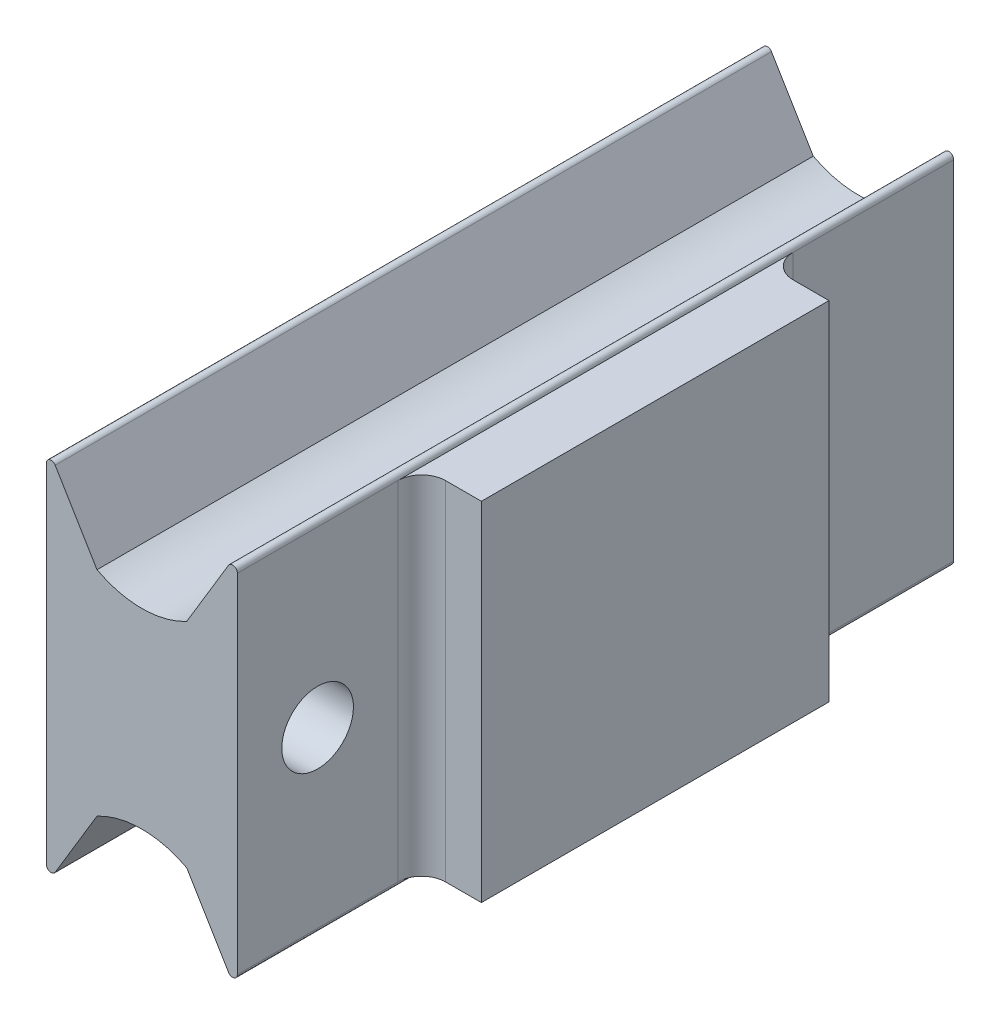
ISO-10303-21;
HEADER;
FILE_DESCRIPTION(('STEP AP214'),'2;1');
FILE_NAME('part.step','',(''),(''),'','','');
FILE_SCHEMA(('AUTOMOTIVE_DESIGN { 1 0 10303 214 1 1 1 1 }'));
ENDSEC;
DATA;
#1=APPLICATION_CONTEXT('core data for automotive mechanical design processes');
#2=APPLICATION_PROTOCOL_DEFINITION('international standard','automotive_design',2000,#1);
#3=PRODUCT_CONTEXT('',#1,'mechanical');
#4=PRODUCT('Part','Part','',(#3));
#5=PRODUCT_RELATED_PRODUCT_CATEGORY('part','',(#4));
#6=PRODUCT_DEFINITION_FORMATION('','',#4);
#7=PRODUCT_DEFINITION_CONTEXT('part definition',#1,'design');
#8=PRODUCT_DEFINITION('design','',#6,#7);
#9=PRODUCT_DEFINITION_SHAPE('','',#8);
#10=(LENGTH_UNIT() NAMED_UNIT(*) SI_UNIT(.MILLI.,.METRE.));
#11=(NAMED_UNIT(*) PLANE_ANGLE_UNIT() SI_UNIT($,.RADIAN.));
#12=(NAMED_UNIT(*) SI_UNIT($,.STERADIAN.) SOLID_ANGLE_UNIT());
#13=UNCERTAINTY_MEASURE_WITH_UNIT(LENGTH_MEASURE(1.E-05),#10,'distance_accuracy_value','');
#14=(GEOMETRIC_REPRESENTATION_CONTEXT(3) GLOBAL_UNCERTAINTY_ASSIGNED_CONTEXT((#13)) GLOBAL_UNIT_ASSIGNED_CONTEXT((#10,
#11,#12)) REPRESENTATION_CONTEXT('',''));
#15=CARTESIAN_POINT('',(0.,0.,0.));
#16=DIRECTION('',(0.,0.,1.));
#17=DIRECTION('',(1.,0.,0.));
#18=AXIS2_PLACEMENT_3D('',#15,#16,#17);
#19=CARTESIAN_POINT('',(-4.,0.,15.));
#20=DIRECTION('',(-1.,0.,0.));
#21=DIRECTION('',(0.,-1.,0.));
#22=AXIS2_PLACEMENT_3D('',#19,#20,#21);
#23=PLANE('',#22);
#24=CARTESIAN_POINT('',(-4.,0.,11.6394116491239));
#25=DIRECTION('',(-1.,0.,0.));
#26=DIRECTION('',(0.,-1.,0.));
#27=AXIS2_PLACEMENT_3D('',#24,#25,#26);
#28=CIRCLE('',#27,1.5);
#29=CARTESIAN_POINT('',(-4.,-1.50000000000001,11.6394116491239));
#30=VERTEX_POINT('',#29);
#31=EDGE_CURVE('E252',#30,#30,#28,.T.);
#32=ORIENTED_EDGE('',*,*,#31,.F.);
#33=EDGE_LOOP('',(#32));
#34=FACE_BOUND('',#33,.T.);
#35=DIRECTION('',(0.,1.,0.));
#36=VECTOR('',#35,1.);
#37=CARTESIAN_POINT('',(-4.,0.,-15.));
#38=LINE('',#37,#36);
#39=CARTESIAN_POINT('',(-4.,-7.27882329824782,-15.));
#40=VERTEX_POINT('',#39);
#41=CARTESIAN_POINT('',(-4.,7.27882329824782,-15.));
#42=VERTEX_POINT('',#41);
#43=EDGE_CURVE('E340',#40,#42,#38,.T.);
#44=ORIENTED_EDGE('',*,*,#43,.F.);
#45=DIRECTION('',(0.,0.,-1.));
#46=VECTOR('',#45,1.);
#47=CARTESIAN_POINT('',(-4.,-7.27882329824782,15.));
#48=LINE('',#47,#46);
#49=CARTESIAN_POINT('',(-4.,-7.27882329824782,15.));
#50=VERTEX_POINT('',#49);
#51=EDGE_CURVE('E381',#40,#50,#48,.F.);
#52=ORIENTED_EDGE('',*,*,#51,.T.);
#53=DIRECTION('',(0.,1.,0.));
#54=VECTOR('',#53,1.);
#55=CARTESIAN_POINT('',(-4.,0.,15.));
#56=LINE('',#55,#54);
#57=CARTESIAN_POINT('',(-4.,7.27882329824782,15.));
#58=VERTEX_POINT('',#57);
#59=EDGE_CURVE('E312',#50,#58,#56,.T.);
#60=ORIENTED_EDGE('',*,*,#59,.T.);
#61=DIRECTION('',(0.,0.,-1.));
#62=VECTOR('',#61,1.);
#63=CARTESIAN_POINT('',(-4.,7.27882329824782,15.));
#64=LINE('',#63,#62);
#65=EDGE_CURVE('E377',#58,#42,#64,.T.);
#66=ORIENTED_EDGE('',*,*,#65,.T.);
#67=EDGE_LOOP('',(#44,#52,#60,#66));
#68=FACE_BOUND('',#67,.T.);
#69=DIRECTION('',(0.,0.,-1.));
#70=VECTOR('',#69,1.);
#71=CARTESIAN_POINT('',(-4.,3.24999999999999,-9.6));
#72=LINE('',#71,#70);
#73=CARTESIAN_POINT('',(-4.,3.24999999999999,-9.6));
#74=VERTEX_POINT('',#73);
#75=CARTESIAN_POINT('',(-4.,3.25,-13.8));
#76=VERTEX_POINT('',#75);
#77=EDGE_CURVE('E244',#74,#76,#72,.T.);
#78=ORIENTED_EDGE('',*,*,#77,.F.);
#79=DIRECTION('',(0.,1.,0.));
#80=VECTOR('',#79,1.);
#81=CARTESIAN_POINT('',(-4.,0.,-9.6));
#82=LINE('',#81,#80);
#83=CARTESIAN_POINT('',(-4.,-3.25,-9.6));
#84=VERTEX_POINT('',#83);
#85=EDGE_CURVE('E216',#84,#74,#82,.T.);
#86=ORIENTED_EDGE('',*,*,#85,.F.);
#87=DIRECTION('',(0.,0.,-1.));
#88=VECTOR('',#87,1.);
#89=CARTESIAN_POINT('',(-4.,-3.25,-9.6));
#90=LINE('',#89,#88);
#91=CARTESIAN_POINT('',(-4.,-3.25,-13.8));
#92=VERTEX_POINT('',#91);
#93=EDGE_CURVE('E205',#84,#92,#90,.T.);
#94=ORIENTED_EDGE('',*,*,#93,.T.);
#95=DIRECTION('',(0.,1.,0.));
#96=VECTOR('',#95,1.);
#97=CARTESIAN_POINT('',(-4.,0.,-13.8));
#98=LINE('',#97,#96);
#99=EDGE_CURVE('E223',#92,#76,#98,.T.);
#100=ORIENTED_EDGE('',*,*,#99,.T.);
#101=EDGE_LOOP('',(#78,#86,#94,#100));
#102=FACE_BOUND('',#101,.T.);
#103=ADVANCED_FACE('F41',(#34,#68,#102),#23,.T.);
#104=CARTESIAN_POINT('',(4.,0.,15.));
#105=DIRECTION('',(-1.,0.,0.));
#106=DIRECTION('',(0.,-1.,0.));
#107=AXIS2_PLACEMENT_3D('',#104,#105,#106);
#108=PLANE('',#107);
#109=DIRECTION('',(0.,0.,-1.));
#110=VECTOR('',#109,1.);
#111=CARTESIAN_POINT('',(4.,7.27882329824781,15.));
#112=LINE('',#111,#110);
#113=CARTESIAN_POINT('',(4.,7.27882329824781,-15.));
#114=VERTEX_POINT('',#113);
#115=CARTESIAN_POINT('',(4.,7.27882329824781,-8.27882329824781));
#116=VERTEX_POINT('',#115);
#117=EDGE_CURVE('E397',#114,#116,#112,.F.);
#118=ORIENTED_EDGE('',*,*,#117,.T.);
#119=DIRECTION('',(0.,1.,0.));
#120=VECTOR('',#119,1.);
#121=CARTESIAN_POINT('',(4.,-7.27882329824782,-8.27882329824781));
#122=LINE('',#121,#120);
#123=CARTESIAN_POINT('',(4.,-7.27882329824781,-8.2788232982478));
#124=VERTEX_POINT('',#123);
#125=EDGE_CURVE('E419',#116,#124,#122,.F.);
#126=ORIENTED_EDGE('',*,*,#125,.T.);
#127=DIRECTION('',(0.,0.,-1.));
#128=VECTOR('',#127,1.);
#129=CARTESIAN_POINT('',(4.,-7.27882329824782,-15.));
#130=LINE('',#129,#128);
#131=CARTESIAN_POINT('',(4.,-7.27882329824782,-15.));
#132=VERTEX_POINT('',#131);
#133=EDGE_CURVE('E401',#124,#132,#130,.T.);
#134=ORIENTED_EDGE('',*,*,#133,.T.);
#135=DIRECTION('',(0.,1.,0.));
#136=VECTOR('',#135,1.);
#137=CARTESIAN_POINT('',(4.,0.,-15.));
#138=LINE('',#137,#136);
#139=EDGE_CURVE('E326',#132,#114,#138,.T.);
#140=ORIENTED_EDGE('',*,*,#139,.T.);
#141=EDGE_LOOP('',(#118,#126,#134,#140));
#142=FACE_BOUND('',#141,.T.);
#143=ADVANCED_FACE('F447',(#142),#108,.F.);
#144=CARTESIAN_POINT('',(0.,-8.00000000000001,15.));
#145=DIRECTION('',(0.,0.,-1.));
#146=DIRECTION('',(-1.,0.,0.));
#147=AXIS2_PLACEMENT_3D('',#144,#145,#146);
#148=CYLINDRICAL_SURFACE('',#147,4.);
#149=CARTESIAN_POINT('',(0.,-8.00000000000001,-15.));
#150=DIRECTION('',(0.,0.,1.));
#151=DIRECTION('',(1.,0.,0.));
#152=AXIS2_PLACEMENT_3D('',#149,#150,#151);
#153=CIRCLE('',#152,4.);
#154=CARTESIAN_POINT('',(1.8778862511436,-4.46820962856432,-15.));
#155=VERTEX_POINT('',#154);
#156=CARTESIAN_POINT('',(-1.8778862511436,-4.46820962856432,-15.));
#157=VERTEX_POINT('',#156);
#158=EDGE_CURVE('E289',#155,#157,#153,.T.);
#159=ORIENTED_EDGE('',*,*,#158,.F.);
#160=DIRECTION('',(0.,0.,-1.));
#161=VECTOR('',#160,1.);
#162=CARTESIAN_POINT('',(1.8778862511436,-4.46820962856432,15.));
#163=LINE('',#162,#161);
#164=CARTESIAN_POINT('',(1.8778862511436,-4.46820962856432,15.));
#165=VERTEX_POINT('',#164);
#166=EDGE_CURVE('E357',#165,#155,#163,.T.);
#167=ORIENTED_EDGE('',*,*,#166,.F.);
#168=CARTESIAN_POINT('',(0.,-8.00000000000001,15.));
#169=DIRECTION('',(0.,0.,1.));
#170=DIRECTION('',(1.,0.,0.));
#171=AXIS2_PLACEMENT_3D('',#168,#169,#170);
#172=CIRCLE('',#171,4.);
#173=CARTESIAN_POINT('',(-1.8778862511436,-4.46820962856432,15.));
#174=VERTEX_POINT('',#173);
#175=EDGE_CURVE('E290',#165,#174,#172,.T.);
#176=ORIENTED_EDGE('',*,*,#175,.T.);
#177=DIRECTION('',(0.,0.,-1.));
#178=VECTOR('',#177,1.);
#179=CARTESIAN_POINT('',(-1.8778862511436,-4.46820962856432,15.));
#180=LINE('',#179,#178);
#181=EDGE_CURVE('E319',#174,#157,#180,.T.);
#182=ORIENTED_EDGE('',*,*,#181,.T.);
#183=EDGE_LOOP('',(#159,#167,#176,#182));
#184=FACE_BOUND('',#183,.T.);
#185=ADVANCED_FACE('F531',(#184),#148,.F.);
#186=CARTESIAN_POINT('',(-0.592847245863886,-0.356218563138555,15.));
#187=DIRECTION('',(-0.857167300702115,-0.515038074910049,0.));
#188=DIRECTION('',(0.515038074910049,-0.857167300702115,0.));
#189=AXIS2_PLACEMENT_3D('',#186,#187,#188);
#190=PLANE('',#189);
#191=DIRECTION('',(-0.515038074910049,0.857167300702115,0.));
#192=VECTOR('',#191,1.);
#193=CARTESIAN_POINT('',(-0.592847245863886,-0.356218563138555,-15.));
#194=LINE('',#193,#192);
#195=CARTESIAN_POINT('',(3.62856653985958,-7.38183091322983,-15.));
#196=VERTEX_POINT('',#195);
#197=EDGE_CURVE('E323',#196,#155,#194,.T.);
#198=ORIENTED_EDGE('',*,*,#197,.F.);
#199=DIRECTION('',(0.,0.,-1.));
#200=VECTOR('',#199,1.);
#201=CARTESIAN_POINT('',(3.62856653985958,-7.38183091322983,15.));
#202=LINE('',#201,#200);
#203=CARTESIAN_POINT('',(3.62856653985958,-7.38183091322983,15.));
#204=VERTEX_POINT('',#203);
#205=EDGE_CURVE('E405',#196,#204,#202,.F.);
#206=ORIENTED_EDGE('',*,*,#205,.T.);
#207=DIRECTION('',(-0.515038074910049,0.857167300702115,0.));
#208=VECTOR('',#207,1.);
#209=CARTESIAN_POINT('',(-0.592847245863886,-0.356218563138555,15.));
#210=LINE('',#209,#208);
#211=EDGE_CURVE('E294',#204,#165,#210,.T.);
#212=ORIENTED_EDGE('',*,*,#211,.T.);
#213=ORIENTED_EDGE('',*,*,#166,.T.);
#214=EDGE_LOOP('',(#198,#206,#212,#213));
#215=FACE_BOUND('',#214,.T.);
#216=ADVANCED_FACE('F527',(#215),#190,.T.);
#217=CARTESIAN_POINT('',(4.,0.,11.6394116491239));
#218=DIRECTION('',(1.,0.,0.));
#219=DIRECTION('',(0.,1.,0.));
#220=AXIS2_PLACEMENT_3D('',#217,#218,#219);
#221=CIRCLE('',#220,1.5);
#222=CARTESIAN_POINT('',(4.,1.5,11.6394116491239));
#223=VERTEX_POINT('',#222);
#224=EDGE_CURVE('E243',#223,#223,#221,.T.);
#225=ORIENTED_EDGE('',*,*,#224,.F.);
#226=EDGE_LOOP('',(#225));
#227=FACE_BOUND('',#226,.T.);
#228=CARTESIAN_POINT('',(4.,-7.27882329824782,15.));
#229=VERTEX_POINT('',#228);
#230=CARTESIAN_POINT('',(4.,-7.27882329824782,8.27882329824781));
#231=VERTEX_POINT('',#230);
#232=EDGE_CURVE('E402',#229,#231,#130,.T.);
#233=ORIENTED_EDGE('',*,*,#232,.T.);
#234=DIRECTION('',(0.,1.,0.));
#235=VECTOR('',#234,1.);
#236=CARTESIAN_POINT('',(4.,0.,8.27882329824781));
#237=LINE('',#236,#235);
#238=CARTESIAN_POINT('',(4.,7.27882329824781,8.27882329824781));
#239=VERTEX_POINT('',#238);
#240=EDGE_CURVE('E423',#231,#239,#237,.T.);
#241=ORIENTED_EDGE('',*,*,#240,.T.);
#242=CARTESIAN_POINT('',(4.,7.27882329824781,15.));
#243=VERTEX_POINT('',#242);
#244=EDGE_CURVE('E396',#239,#243,#112,.F.);
#245=ORIENTED_EDGE('',*,*,#244,.T.);
#246=DIRECTION('',(0.,1.,0.));
#247=VECTOR('',#246,1.);
#248=CARTESIAN_POINT('',(4.,0.,15.));
#249=LINE('',#248,#247);
#250=EDGE_CURVE('E298',#229,#243,#249,.T.);
#251=ORIENTED_EDGE('',*,*,#250,.F.);
#252=EDGE_LOOP('',(#233,#241,#245,#251));
#253=FACE_BOUND('',#252,.T.);
#254=ADVANCED_FACE('F523',(#227,#253),#108,.F.);
#255=CARTESIAN_POINT('',(-0.592847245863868,0.356218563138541,15.));
#256=DIRECTION('',(0.857167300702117,-0.515038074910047,0.));
#257=DIRECTION('',(0.515038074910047,0.857167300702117,0.));
#258=AXIS2_PLACEMENT_3D('',#255,#256,#257);
#259=PLANE('',#258);
#260=DIRECTION('',(-0.515038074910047,-0.857167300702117,0.));
#261=VECTOR('',#260,1.);
#262=CARTESIAN_POINT('',(-0.592847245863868,0.356218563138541,15.));
#263=LINE('',#262,#261);
#264=CARTESIAN_POINT('',(3.62856653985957,7.38183091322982,15.));
#265=VERTEX_POINT('',#264);
#266=CARTESIAN_POINT('',(1.87788625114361,4.46820962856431,15.));
#267=VERTEX_POINT('',#266);
#268=EDGE_CURVE('E302',#265,#267,#263,.T.);
#269=ORIENTED_EDGE('',*,*,#268,.F.);
#270=DIRECTION('',(0.,0.,-1.));
#271=VECTOR('',#270,1.);
#272=CARTESIAN_POINT('',(3.62856653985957,7.38183091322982,15.));
#273=LINE('',#272,#271);
#274=CARTESIAN_POINT('',(3.62856653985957,7.38183091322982,-15.));
#275=VERTEX_POINT('',#274);
#276=EDGE_CURVE('E411',#265,#275,#273,.T.);
#277=ORIENTED_EDGE('',*,*,#276,.T.);
#278=DIRECTION('',(-0.515038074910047,-0.857167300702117,0.));
#279=VECTOR('',#278,1.);
#280=CARTESIAN_POINT('',(-0.592847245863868,0.356218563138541,-15.));
#281=LINE('',#280,#279);
#282=CARTESIAN_POINT('',(1.87788625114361,4.46820962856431,-15.));
#283=VERTEX_POINT('',#282);
#284=EDGE_CURVE('E330',#275,#283,#281,.T.);
#285=ORIENTED_EDGE('',*,*,#284,.T.);
#286=DIRECTION('',(0.,0.,-1.));
#287=VECTOR('',#286,1.);
#288=CARTESIAN_POINT('',(1.87788625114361,4.46820962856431,15.));
#289=LINE('',#288,#287);
#290=EDGE_CURVE('E353',#267,#283,#289,.T.);
#291=ORIENTED_EDGE('',*,*,#290,.F.);
#292=EDGE_LOOP('',(#269,#277,#285,#291));
#293=FACE_BOUND('',#292,.T.);
#294=ADVANCED_FACE('F519',(#293),#259,.F.);
#295=CARTESIAN_POINT('',(0.,8.,15.));
#296=DIRECTION('',(0.,0.,-1.));
#297=DIRECTION('',(-1.,0.,0.));
#298=AXIS2_PLACEMENT_3D('',#295,#296,#297);
#299=CYLINDRICAL_SURFACE('',#298,4.);
#300=CARTESIAN_POINT('',(0.,8.,-15.));
#301=DIRECTION('',(0.,0.,1.));
#302=DIRECTION('',(1.,0.,0.));
#303=AXIS2_PLACEMENT_3D('',#300,#301,#302);
#304=CIRCLE('',#303,4.);
#305=CARTESIAN_POINT('',(-1.87788625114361,4.46820962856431,-15.));
#306=VERTEX_POINT('',#305);
#307=EDGE_CURVE('E333',#283,#306,#304,.F.);
#308=ORIENTED_EDGE('',*,*,#307,.T.);
#309=DIRECTION('',(0.,0.,-1.));
#310=VECTOR('',#309,1.);
#311=CARTESIAN_POINT('',(-1.87788625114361,4.46820962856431,15.));
#312=LINE('',#311,#310);
#313=CARTESIAN_POINT('',(-1.87788625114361,4.46820962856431,15.));
#314=VERTEX_POINT('',#313);
#315=EDGE_CURVE('E349',#314,#306,#312,.T.);
#316=ORIENTED_EDGE('',*,*,#315,.F.);
#317=CARTESIAN_POINT('',(0.,8.,15.));
#318=DIRECTION('',(0.,0.,1.));
#319=DIRECTION('',(1.,0.,0.));
#320=AXIS2_PLACEMENT_3D('',#317,#318,#319);
#321=CIRCLE('',#320,4.);
#322=EDGE_CURVE('E305',#267,#314,#321,.F.);
#323=ORIENTED_EDGE('',*,*,#322,.F.);
#324=ORIENTED_EDGE('',*,*,#290,.T.);
#325=EDGE_LOOP('',(#308,#316,#323,#324));
#326=FACE_BOUND('',#325,.T.);
#327=ADVANCED_FACE('F515',(#326),#299,.F.);
#328=CARTESIAN_POINT('',(0.592847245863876,0.356218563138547,15.));
#329=DIRECTION('',(0.857167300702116,0.515038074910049,0.));
#330=DIRECTION('',(-0.515038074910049,0.857167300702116,0.));
#331=AXIS2_PLACEMENT_3D('',#328,#329,#330);
#332=PLANE('',#331);
#333=DIRECTION('',(0.515038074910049,-0.857167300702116,0.));
#334=VECTOR('',#333,1.);
#335=CARTESIAN_POINT('',(0.592847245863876,0.356218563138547,-15.));
#336=LINE('',#335,#334);
#337=CARTESIAN_POINT('',(-3.62856653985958,7.38183091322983,-15.));
#338=VERTEX_POINT('',#337);
#339=EDGE_CURVE('E337',#338,#306,#336,.T.);
#340=ORIENTED_EDGE('',*,*,#339,.F.);
#341=DIRECTION('',(0.,0.,-1.));
#342=VECTOR('',#341,1.);
#343=CARTESIAN_POINT('',(-3.62856653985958,7.38183091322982,15.));
#344=LINE('',#343,#342);
#345=CARTESIAN_POINT('',(-3.62856653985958,7.38183091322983,15.));
#346=VERTEX_POINT('',#345);
#347=EDGE_CURVE('E408',#338,#346,#344,.F.);
#348=ORIENTED_EDGE('',*,*,#347,.T.);
#349=DIRECTION('',(0.515038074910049,-0.857167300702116,0.));
#350=VECTOR('',#349,1.);
#351=CARTESIAN_POINT('',(0.592847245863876,0.356218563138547,15.));
#352=LINE('',#351,#350);
#353=EDGE_CURVE('E309',#346,#314,#352,.T.);
#354=ORIENTED_EDGE('',*,*,#353,.T.);
#355=ORIENTED_EDGE('',*,*,#315,.T.);
#356=EDGE_LOOP('',(#340,#348,#354,#355));
#357=FACE_BOUND('',#356,.T.);
#358=ADVANCED_FACE('F510',(#357),#332,.T.);
#359=CARTESIAN_POINT('',(0.592847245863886,-0.356218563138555,15.));
#360=DIRECTION('',(-0.857167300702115,0.515038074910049,0.));
#361=DIRECTION('',(-0.515038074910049,-0.857167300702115,0.));
#362=AXIS2_PLACEMENT_3D('',#359,#360,#361);
#363=PLANE('',#362);
#364=DIRECTION('',(0.515038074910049,0.857167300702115,0.));
#365=VECTOR('',#364,1.);
#366=CARTESIAN_POINT('',(0.592847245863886,-0.356218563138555,15.));
#367=LINE('',#366,#365);
#368=CARTESIAN_POINT('',(-3.62856653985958,-7.38183091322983,15.));
#369=VERTEX_POINT('',#368);
#370=EDGE_CURVE('E316',#369,#174,#367,.T.);
#371=ORIENTED_EDGE('',*,*,#370,.F.);
#372=DIRECTION('',(0.,0.,-1.));
#373=VECTOR('',#372,1.);
#374=CARTESIAN_POINT('',(-3.62856653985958,-7.38183091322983,-15.));
#375=LINE('',#374,#373);
#376=CARTESIAN_POINT('',(-3.62856653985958,-7.38183091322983,-15.));
#377=VERTEX_POINT('',#376);
#378=EDGE_CURVE('E361',#369,#377,#375,.T.);
#379=ORIENTED_EDGE('',*,*,#378,.T.);
#380=DIRECTION('',(0.515038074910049,0.857167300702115,0.));
#381=VECTOR('',#380,1.);
#382=CARTESIAN_POINT('',(0.592847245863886,-0.356218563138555,-15.));
#383=LINE('',#382,#381);
#384=EDGE_CURVE('E295',#377,#157,#383,.T.);
#385=ORIENTED_EDGE('',*,*,#384,.T.);
#386=ORIENTED_EDGE('',*,*,#181,.F.);
#387=EDGE_LOOP('',(#371,#379,#385,#386));
#388=FACE_BOUND('',#387,.T.);
#389=ADVANCED_FACE('F503',(#388),#363,.F.);
#390=CARTESIAN_POINT('',(0.,0.,15.));
#391=DIRECTION('',(0.,0.,1.));
#392=DIRECTION('',(1.,0.,0.));
#393=AXIS2_PLACEMENT_3D('',#390,#391,#392);
#394=PLANE('',#393);
#395=ORIENTED_EDGE('',*,*,#59,.F.);
#396=CARTESIAN_POINT('',(-3.8,-7.27882329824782,15.));
#397=DIRECTION('',(0.,0.,1.));
#398=DIRECTION('',(1.,0.,0.));
#399=AXIS2_PLACEMENT_3D('',#396,#397,#398);
#400=CIRCLE('',#399,0.2);
#401=EDGE_CURVE('E393',#50,#369,#400,.T.);
#402=ORIENTED_EDGE('',*,*,#401,.T.);
#403=ORIENTED_EDGE('',*,*,#370,.T.);
#404=ORIENTED_EDGE('',*,*,#175,.F.);
#405=ORIENTED_EDGE('',*,*,#211,.F.);
#406=CARTESIAN_POINT('',(3.8,-7.27882329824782,15.));
#407=DIRECTION('',(0.,0.,1.));
#408=DIRECTION('',(1.,0.,0.));
#409=AXIS2_PLACEMENT_3D('',#406,#407,#408);
#410=CIRCLE('',#409,0.2);
#411=EDGE_CURVE('E390',#204,#229,#410,.T.);
#412=ORIENTED_EDGE('',*,*,#411,.T.);
#413=ORIENTED_EDGE('',*,*,#250,.T.);
#414=CARTESIAN_POINT('',(3.8,7.27882329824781,15.));
#415=DIRECTION('',(0.,0.,1.));
#416=DIRECTION('',(1.,0.,0.));
#417=AXIS2_PLACEMENT_3D('',#414,#415,#416);
#418=CIRCLE('',#417,0.2);
#419=EDGE_CURVE('E384',#243,#265,#418,.T.);
#420=ORIENTED_EDGE('',*,*,#419,.T.);
#421=ORIENTED_EDGE('',*,*,#268,.T.);
#422=ORIENTED_EDGE('',*,*,#322,.T.);
#423=ORIENTED_EDGE('',*,*,#353,.F.);
#424=CARTESIAN_POINT('',(-3.8,7.27882329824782,15.));
#425=DIRECTION('',(0.,0.,1.));
#426=DIRECTION('',(1.,0.,0.));
#427=AXIS2_PLACEMENT_3D('',#424,#425,#426);
#428=CIRCLE('',#427,0.2);
#429=EDGE_CURVE('E387',#346,#58,#428,.T.);
#430=ORIENTED_EDGE('',*,*,#429,.T.);
#431=EDGE_LOOP('',(#395,#402,#403,#404,#405,#412,#413,#420,#421,#422,#423,#430));
#432=FACE_BOUND('',#431,.T.);
#433=ADVANCED_FACE('F499',(#432),#394,.T.);
#434=CARTESIAN_POINT('',(0.,0.,-15.));
#435=DIRECTION('',(0.,0.,1.));
#436=DIRECTION('',(1.,0.,0.));
#437=AXIS2_PLACEMENT_3D('',#434,#435,#436);
#438=PLANE('',#437);
#439=CARTESIAN_POINT('',(0.,0.,-15.));
#440=DIRECTION('',(0.,0.,-1.));
#441=DIRECTION('',(-1.,0.,0.));
#442=AXIS2_PLACEMENT_3D('',#439,#440,#441);
#443=CIRCLE('',#442,1.65);
#444=CARTESIAN_POINT('',(-1.65,0.,-15.));
#445=VERTEX_POINT('',#444);
#446=EDGE_CURVE('E226',#445,#445,#443,.T.);
#447=ORIENTED_EDGE('',*,*,#446,.F.);
#448=EDGE_LOOP('',(#447));
#449=FACE_BOUND('',#448,.T.);
#450=ORIENTED_EDGE('',*,*,#384,.F.);
#451=CARTESIAN_POINT('',(-3.8,-7.27882329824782,-15.));
#452=DIRECTION('',(0.,0.,1.));
#453=DIRECTION('',(1.,0.,0.));
#454=AXIS2_PLACEMENT_3D('',#451,#452,#453);
#455=CIRCLE('',#454,0.2);
#456=EDGE_CURVE('E374',#377,#40,#455,.F.);
#457=ORIENTED_EDGE('',*,*,#456,.T.);
#458=ORIENTED_EDGE('',*,*,#43,.T.);
#459=CARTESIAN_POINT('',(-3.8,7.27882329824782,-15.));
#460=DIRECTION('',(0.,0.,1.));
#461=DIRECTION('',(1.,0.,0.));
#462=AXIS2_PLACEMENT_3D('',#459,#460,#461);
#463=CIRCLE('',#462,0.2);
#464=EDGE_CURVE('E368',#42,#338,#463,.F.);
#465=ORIENTED_EDGE('',*,*,#464,.T.);
#466=ORIENTED_EDGE('',*,*,#339,.T.);
#467=ORIENTED_EDGE('',*,*,#307,.F.);
#468=ORIENTED_EDGE('',*,*,#284,.F.);
#469=CARTESIAN_POINT('',(3.8,7.27882329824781,-15.));
#470=DIRECTION('',(0.,0.,1.));
#471=DIRECTION('',(1.,0.,0.));
#472=AXIS2_PLACEMENT_3D('',#469,#470,#471);
#473=CIRCLE('',#472,0.2);
#474=EDGE_CURVE('E365',#275,#114,#473,.F.);
#475=ORIENTED_EDGE('',*,*,#474,.T.);
#476=ORIENTED_EDGE('',*,*,#139,.F.);
#477=CARTESIAN_POINT('',(3.8,-7.27882329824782,-15.));
#478=DIRECTION('',(0.,0.,1.));
#479=DIRECTION('',(1.,0.,0.));
#480=AXIS2_PLACEMENT_3D('',#477,#478,#479);
#481=CIRCLE('',#480,0.2);
#482=EDGE_CURVE('E371',#132,#196,#481,.F.);
#483=ORIENTED_EDGE('',*,*,#482,.T.);
#484=ORIENTED_EDGE('',*,*,#197,.T.);
#485=ORIENTED_EDGE('',*,*,#158,.T.);
#486=EDGE_LOOP('',(#450,#457,#458,#465,#466,#467,#468,#475,#476,#483,#484,#485));
#487=FACE_BOUND('',#486,.T.);
#488=ADVANCED_FACE('F502',(#449,#487),#438,.F.);
#489=CARTESIAN_POINT('',(-3.8,-7.27882329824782,15.));
#490=DIRECTION('',(0.,0.,1.));
#491=DIRECTION('',(1.,0.,0.));
#492=AXIS2_PLACEMENT_3D('',#489,#490,#491);
#493=CYLINDRICAL_SURFACE('',#492,0.2);
#494=ORIENTED_EDGE('',*,*,#401,.F.);
#495=ORIENTED_EDGE('',*,*,#51,.F.);
#496=ORIENTED_EDGE('',*,*,#456,.F.);
#497=ORIENTED_EDGE('',*,*,#378,.F.);
#498=EDGE_LOOP('',(#494,#495,#496,#497));
#499=FACE_BOUND('',#498,.T.);
#500=ADVANCED_FACE('F507',(#499),#493,.T.);
#501=CARTESIAN_POINT('',(3.8,-7.27882329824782,15.));
#502=DIRECTION('',(0.,0.,1.));
#503=DIRECTION('',(1.,0.,0.));
#504=AXIS2_PLACEMENT_3D('',#501,#502,#503);
#505=CYLINDRICAL_SURFACE('',#504,0.2);
#506=ORIENTED_EDGE('',*,*,#411,.F.);
#507=ORIENTED_EDGE('',*,*,#205,.F.);
#508=ORIENTED_EDGE('',*,*,#482,.F.);
#509=ORIENTED_EDGE('',*,*,#133,.F.);
#510=DIRECTION('',(0.,0.,-1.));
#511=VECTOR('',#510,1.);
#512=CARTESIAN_POINT('',(4.,-7.27882329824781,7.27882329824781));
#513=LINE('',#512,#511);
#514=EDGE_CURVE('E67',#231,#124,#513,.T.);
#515=ORIENTED_EDGE('',*,*,#514,.F.);
#516=ORIENTED_EDGE('',*,*,#232,.F.);
#517=EDGE_LOOP('',(#506,#507,#508,#509,#515,#516));
#518=FACE_BOUND('',#517,.T.);
#519=ADVANCED_FACE('F538',(#518),#505,.T.);
#520=CARTESIAN_POINT('',(-3.8,7.27882329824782,15.));
#521=DIRECTION('',(0.,0.,-1.));
#522=DIRECTION('',(-1.,0.,0.));
#523=AXIS2_PLACEMENT_3D('',#520,#521,#522);
#524=CYLINDRICAL_SURFACE('',#523,0.2);
#525=ORIENTED_EDGE('',*,*,#429,.F.);
#526=ORIENTED_EDGE('',*,*,#347,.F.);
#527=ORIENTED_EDGE('',*,*,#464,.F.);
#528=ORIENTED_EDGE('',*,*,#65,.F.);
#529=EDGE_LOOP('',(#525,#526,#527,#528));
#530=FACE_BOUND('',#529,.T.);
#531=ADVANCED_FACE('F542',(#530),#524,.T.);
#532=CARTESIAN_POINT('',(3.8,7.27882329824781,15.));
#533=DIRECTION('',(0.,0.,-1.));
#534=DIRECTION('',(-1.,0.,0.));
#535=AXIS2_PLACEMENT_3D('',#532,#533,#534);
#536=CYLINDRICAL_SURFACE('',#535,0.2);
#537=ORIENTED_EDGE('',*,*,#419,.F.);
#538=ORIENTED_EDGE('',*,*,#244,.F.);
#539=DIRECTION('',(0.,0.,-1.));
#540=VECTOR('',#539,1.);
#541=CARTESIAN_POINT('',(4.,7.27882329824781,7.27882329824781));
#542=LINE('',#541,#540);
#543=EDGE_CURVE('E258',#239,#116,#542,.T.);
#544=ORIENTED_EDGE('',*,*,#543,.T.);
#545=ORIENTED_EDGE('',*,*,#117,.F.);
#546=ORIENTED_EDGE('',*,*,#474,.F.);
#547=ORIENTED_EDGE('',*,*,#276,.F.);
#548=EDGE_LOOP('',(#537,#538,#544,#545,#546,#547));
#549=FACE_BOUND('',#548,.T.);
#550=ADVANCED_FACE('F497',(#549),#536,.T.);
#551=CARTESIAN_POINT('',(6.5,-7.27882329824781,7.27882329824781));
#552=DIRECTION('',(0.,1.,0.));
#553=DIRECTION('',(-1.,0.,0.));
#554=AXIS2_PLACEMENT_3D('',#551,#552,#553);
#555=PLANE('',#554);
#556=ORIENTED_EDGE('',*,*,#514,.T.);
#557=CARTESIAN_POINT('',(5.,-7.27882329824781,-8.27882329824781));
#558=DIRECTION('',(0.,1.,0.));
#559=DIRECTION('',(-1.,0.,0.));
#560=AXIS2_PLACEMENT_3D('',#557,#558,#559);
#561=CIRCLE('',#560,1.);
#562=CARTESIAN_POINT('',(5.,-7.27882329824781,-7.27882329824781));
#563=VERTEX_POINT('',#562);
#564=EDGE_CURVE('E434',#124,#563,#561,.T.);
#565=ORIENTED_EDGE('',*,*,#564,.T.);
#566=DIRECTION('',(-1.,0.,0.));
#567=VECTOR('',#566,1.);
#568=CARTESIAN_POINT('',(6.5,-7.27882329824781,-7.27882329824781));
#569=LINE('',#568,#567);
#570=CARTESIAN_POINT('',(6.5,-7.27882329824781,-7.27882329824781));
#571=VERTEX_POINT('',#570);
#572=EDGE_CURVE('E285',#571,#563,#569,.T.);
#573=ORIENTED_EDGE('',*,*,#572,.F.);
#574=DIRECTION('',(0.,0.,-1.));
#575=VECTOR('',#574,1.);
#576=CARTESIAN_POINT('',(6.5,-7.27882329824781,7.27882329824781));
#577=LINE('',#576,#575);
#578=CARTESIAN_POINT('',(6.5,-7.27882329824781,7.27882329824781));
#579=VERTEX_POINT('',#578);
#580=EDGE_CURVE('E253',#579,#571,#577,.T.);
#581=ORIENTED_EDGE('',*,*,#580,.F.);
#582=DIRECTION('',(-1.,0.,0.));
#583=VECTOR('',#582,1.);
#584=CARTESIAN_POINT('',(6.5,-7.27882329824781,7.27882329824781));
#585=LINE('',#584,#583);
#586=CARTESIAN_POINT('',(5.,-7.27882329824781,7.27882329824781));
#587=VERTEX_POINT('',#586);
#588=EDGE_CURVE('E269',#579,#587,#585,.T.);
#589=ORIENTED_EDGE('',*,*,#588,.T.);
#590=CARTESIAN_POINT('',(5.,-7.27882329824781,8.27882329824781));
#591=DIRECTION('',(0.,1.,0.));
#592=DIRECTION('',(-1.,0.,0.));
#593=AXIS2_PLACEMENT_3D('',#590,#591,#592);
#594=CIRCLE('',#593,1.);
#595=EDGE_CURVE('E11',#587,#231,#594,.T.);
#596=ORIENTED_EDGE('',*,*,#595,.T.);
#597=EDGE_LOOP('',(#556,#565,#573,#581,#589,#596));
#598=FACE_BOUND('',#597,.T.);
#599=ADVANCED_FACE('F493',(#598),#555,.F.);
#600=CARTESIAN_POINT('',(6.5,-7.27882329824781,-7.27882329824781));
#601=DIRECTION('',(0.,0.,1.));
#602=DIRECTION('',(1.,0.,0.));
#603=AXIS2_PLACEMENT_3D('',#600,#601,#602);
#604=PLANE('',#603);
#605=ORIENTED_EDGE('',*,*,#572,.T.);
#606=DIRECTION('',(0.,1.,0.));
#607=VECTOR('',#606,1.);
#608=CARTESIAN_POINT('',(5.,7.27882329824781,-7.27882329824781));
#609=LINE('',#608,#607);
#610=CARTESIAN_POINT('',(5.,7.27882329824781,-7.27882329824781));
#611=VERTEX_POINT('',#610);
#612=EDGE_CURVE('E415',#563,#611,#609,.T.);
#613=ORIENTED_EDGE('',*,*,#612,.T.);
#614=DIRECTION('',(-1.,0.,0.));
#615=VECTOR('',#614,1.);
#616=CARTESIAN_POINT('',(6.5,7.27882329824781,-7.27882329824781));
#617=LINE('',#616,#615);
#618=CARTESIAN_POINT('',(6.5,7.27882329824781,-7.27882329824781));
#619=VERTEX_POINT('',#618);
#620=EDGE_CURVE('E281',#619,#611,#617,.T.);
#621=ORIENTED_EDGE('',*,*,#620,.F.);
#622=DIRECTION('',(0.,1.,0.));
#623=VECTOR('',#622,1.);
#624=CARTESIAN_POINT('',(6.5,-7.27882329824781,-7.27882329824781));
#625=LINE('',#624,#623);
#626=EDGE_CURVE('E257',#571,#619,#625,.T.);
#627=ORIENTED_EDGE('',*,*,#626,.F.);
#628=EDGE_LOOP('',(#605,#613,#621,#627));
#629=FACE_BOUND('',#628,.T.);
#630=ADVANCED_FACE('F489',(#629),#604,.F.);
#631=CARTESIAN_POINT('',(6.5,7.27882329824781,7.27882329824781));
#632=DIRECTION('',(0.,1.,0.));
#633=DIRECTION('',(-1.,0.,0.));
#634=AXIS2_PLACEMENT_3D('',#631,#632,#633);
#635=PLANE('',#634);
#636=ORIENTED_EDGE('',*,*,#543,.F.);
#637=CARTESIAN_POINT('',(5.,7.27882329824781,8.27882329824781));
#638=DIRECTION('',(0.,1.,0.));
#639=DIRECTION('',(-1.,0.,0.));
#640=AXIS2_PLACEMENT_3D('',#637,#638,#639);
#641=CIRCLE('',#640,1.);
#642=CARTESIAN_POINT('',(5.,7.27882329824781,7.27882329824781));
#643=VERTEX_POINT('',#642);
#644=EDGE_CURVE('E51',#239,#643,#641,.F.);
#645=ORIENTED_EDGE('',*,*,#644,.T.);
#646=DIRECTION('',(-1.,0.,0.));
#647=VECTOR('',#646,1.);
#648=CARTESIAN_POINT('',(6.5,7.27882329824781,7.27882329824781));
#649=LINE('',#648,#647);
#650=CARTESIAN_POINT('',(6.5,7.27882329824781,7.27882329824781));
#651=VERTEX_POINT('',#650);
#652=EDGE_CURVE('E277',#651,#643,#649,.T.);
#653=ORIENTED_EDGE('',*,*,#652,.F.);
#654=DIRECTION('',(0.,0.,-1.));
#655=VECTOR('',#654,1.);
#656=CARTESIAN_POINT('',(6.5,7.27882329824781,7.27882329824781));
#657=LINE('',#656,#655);
#658=EDGE_CURVE('E261',#651,#619,#657,.T.);
#659=ORIENTED_EDGE('',*,*,#658,.T.);
#660=ORIENTED_EDGE('',*,*,#620,.T.);
#661=CARTESIAN_POINT('',(5.,7.27882329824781,-8.27882329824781));
#662=DIRECTION('',(0.,1.,0.));
#663=DIRECTION('',(-1.,0.,0.));
#664=AXIS2_PLACEMENT_3D('',#661,#662,#663);
#665=CIRCLE('',#664,1.);
#666=EDGE_CURVE('E430',#611,#116,#665,.F.);
#667=ORIENTED_EDGE('',*,*,#666,.T.);
#668=EDGE_LOOP('',(#636,#645,#653,#659,#660,#667));
#669=FACE_BOUND('',#668,.T.);
#670=ADVANCED_FACE('F485',(#669),#635,.T.);
#671=CARTESIAN_POINT('',(6.5,-7.27882329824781,7.27882329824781));
#672=DIRECTION('',(0.,0.,1.));
#673=DIRECTION('',(1.,0.,0.));
#674=AXIS2_PLACEMENT_3D('',#671,#672,#673);
#675=PLANE('',#674);
#676=ORIENTED_EDGE('',*,*,#652,.T.);
#677=DIRECTION('',(0.,1.,0.));
#678=VECTOR('',#677,1.);
#679=CARTESIAN_POINT('',(5.,-7.27882329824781,7.27882329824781));
#680=LINE('',#679,#678);
#681=EDGE_CURVE('E427',#643,#587,#680,.F.);
#682=ORIENTED_EDGE('',*,*,#681,.T.);
#683=ORIENTED_EDGE('',*,*,#588,.F.);
#684=DIRECTION('',(0.,1.,0.));
#685=VECTOR('',#684,1.);
#686=CARTESIAN_POINT('',(6.5,-7.27882329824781,7.27882329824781));
#687=LINE('',#686,#685);
#688=EDGE_CURVE('E265',#579,#651,#687,.T.);
#689=ORIENTED_EDGE('',*,*,#688,.T.);
#690=EDGE_LOOP('',(#676,#682,#683,#689));
#691=FACE_BOUND('',#690,.T.);
#692=ADVANCED_FACE('F481',(#691),#675,.T.);
#693=CARTESIAN_POINT('',(6.5,0.,0.));
#694=DIRECTION('',(1.,0.,0.));
#695=DIRECTION('',(0.,1.,0.));
#696=AXIS2_PLACEMENT_3D('',#693,#694,#695);
#697=PLANE('',#696);
#698=ORIENTED_EDGE('',*,*,#580,.T.);
#699=ORIENTED_EDGE('',*,*,#626,.T.);
#700=ORIENTED_EDGE('',*,*,#658,.F.);
#701=ORIENTED_EDGE('',*,*,#688,.F.);
#702=EDGE_LOOP('',(#698,#699,#700,#701));
#703=FACE_BOUND('',#702,.T.);
#704=ADVANCED_FACE('F477',(#703),#697,.T.);
#705=CARTESIAN_POINT('',(5.,-7.27882329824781,-8.27882329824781));
#706=DIRECTION('',(0.,-1.,0.));
#707=DIRECTION('',(1.,0.,0.));
#708=AXIS2_PLACEMENT_3D('',#705,#706,#707);
#709=CYLINDRICAL_SURFACE('',#708,1.);
#710=ORIENTED_EDGE('',*,*,#564,.F.);
#711=ORIENTED_EDGE('',*,*,#125,.F.);
#712=ORIENTED_EDGE('',*,*,#666,.F.);
#713=ORIENTED_EDGE('',*,*,#612,.F.);
#714=EDGE_LOOP('',(#710,#711,#712,#713));
#715=FACE_BOUND('',#714,.T.);
#716=ADVANCED_FACE('F480',(#715),#709,.F.);
#717=CARTESIAN_POINT('',(5.,0.,8.27882329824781));
#718=DIRECTION('',(0.,1.,0.));
#719=DIRECTION('',(-1.,0.,0.));
#720=AXIS2_PLACEMENT_3D('',#717,#718,#719);
#721=CYLINDRICAL_SURFACE('',#720,1.);
#722=ORIENTED_EDGE('',*,*,#595,.F.);
#723=ORIENTED_EDGE('',*,*,#681,.F.);
#724=ORIENTED_EDGE('',*,*,#644,.F.);
#725=ORIENTED_EDGE('',*,*,#240,.F.);
#726=EDGE_LOOP('',(#722,#723,#724,#725));
#727=FACE_BOUND('',#726,.T.);
#728=ADVANCED_FACE('F43',(#727),#721,.F.);
#729=CARTESIAN_POINT('',(-8.5,0.,11.6394116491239));
#730=DIRECTION('',(1.,0.,0.));
#731=DIRECTION('',(0.,1.,0.));
#732=AXIS2_PLACEMENT_3D('',#729,#730,#731);
#733=CYLINDRICAL_SURFACE('',#732,1.5);
#734=ORIENTED_EDGE('',*,*,#31,.T.);
#735=EDGE_LOOP('',(#734));
#736=FACE_BOUND('',#735,.T.);
#737=ORIENTED_EDGE('',*,*,#224,.T.);
#738=EDGE_LOOP('',(#737));
#739=FACE_BOUND('',#738,.T.);
#740=ADVANCED_FACE('F442',(#736,#739),#733,.F.);
#741=CARTESIAN_POINT('',(0.,0.,-9.6));
#742=DIRECTION('',(0.,0.,-1.));
#743=DIRECTION('',(-1.,0.,0.));
#744=AXIS2_PLACEMENT_3D('',#741,#742,#743);
#745=CYLINDRICAL_SURFACE('',#744,3.25);
#746=CARTESIAN_POINT('',(0.,0.,-13.8));
#747=DIRECTION('',(0.,0.,-1.));
#748=DIRECTION('',(-1.,0.,0.));
#749=AXIS2_PLACEMENT_3D('',#746,#747,#748);
#750=CIRCLE('',#749,3.25);
#751=CARTESIAN_POINT('',(0.,3.25,-13.8));
#752=VERTEX_POINT('',#751);
#753=CARTESIAN_POINT('',(0.,-3.25000000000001,-13.8));
#754=VERTEX_POINT('',#753);
#755=EDGE_CURVE('E200',#752,#754,#750,.T.);
#756=ORIENTED_EDGE('',*,*,#755,.T.);
#757=DIRECTION('',(0.,0.,-1.));
#758=VECTOR('',#757,1.);
#759=CARTESIAN_POINT('',(0.,-3.25000000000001,-9.6));
#760=LINE('',#759,#758);
#761=CARTESIAN_POINT('',(0.,-3.25000000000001,-9.6));
#762=VERTEX_POINT('',#761);
#763=EDGE_CURVE('E195',#762,#754,#760,.T.);
#764=ORIENTED_EDGE('',*,*,#763,.F.);
#765=CARTESIAN_POINT('',(0.,0.,-9.6));
#766=DIRECTION('',(0.,0.,-1.));
#767=DIRECTION('',(-1.,0.,0.));
#768=AXIS2_PLACEMENT_3D('',#765,#766,#767);
#769=CIRCLE('',#768,3.25);
#770=CARTESIAN_POINT('',(0.,3.25,-9.6));
#771=VERTEX_POINT('',#770);
#772=EDGE_CURVE('E199',#771,#762,#769,.T.);
#773=ORIENTED_EDGE('',*,*,#772,.F.);
#774=DIRECTION('',(0.,0.,-1.));
#775=VECTOR('',#774,1.);
#776=CARTESIAN_POINT('',(0.,3.25,-9.6));
#777=LINE('',#776,#775);
#778=EDGE_CURVE('E240',#771,#752,#777,.T.);
#779=ORIENTED_EDGE('',*,*,#778,.T.);
#780=EDGE_LOOP('',(#756,#764,#773,#779));
#781=FACE_BOUND('',#780,.T.);
#782=ADVANCED_FACE('F197',(#781),#745,.F.);
#783=CARTESIAN_POINT('',(0.,3.24999999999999,-9.6));
#784=DIRECTION('',(0.,-1.,0.));
#785=DIRECTION('',(0.,0.,-1.));
#786=AXIS2_PLACEMENT_3D('',#783,#784,#785);
#787=PLANE('',#786);
#788=DIRECTION('',(-1.,0.,0.));
#789=VECTOR('',#788,1.);
#790=CARTESIAN_POINT('',(0.,3.24999999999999,-13.8));
#791=LINE('',#790,#789);
#792=EDGE_CURVE('E59',#752,#76,#791,.T.);
#793=ORIENTED_EDGE('',*,*,#792,.F.);
#794=ORIENTED_EDGE('',*,*,#778,.F.);
#795=DIRECTION('',(-1.,0.,0.));
#796=VECTOR('',#795,1.);
#797=CARTESIAN_POINT('',(0.,3.24999999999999,-9.6));
#798=LINE('',#797,#796);
#799=EDGE_CURVE('E206',#771,#74,#798,.T.);
#800=ORIENTED_EDGE('',*,*,#799,.T.);
#801=ORIENTED_EDGE('',*,*,#77,.T.);
#802=EDGE_LOOP('',(#793,#794,#800,#801));
#803=FACE_BOUND('',#802,.T.);
#804=ADVANCED_FACE('F454',(#803),#787,.T.);
#805=CARTESIAN_POINT('',(0.,-3.25,-9.6));
#806=DIRECTION('',(0.,-1.,0.));
#807=DIRECTION('',(0.,0.,-1.));
#808=AXIS2_PLACEMENT_3D('',#805,#806,#807);
#809=PLANE('',#808);
#810=DIRECTION('',(-1.,0.,0.));
#811=VECTOR('',#810,1.);
#812=CARTESIAN_POINT('',(0.,-3.25,-13.8));
#813=LINE('',#812,#811);
#814=EDGE_CURVE('E234',#754,#92,#813,.T.);
#815=ORIENTED_EDGE('',*,*,#814,.T.);
#816=ORIENTED_EDGE('',*,*,#93,.F.);
#817=DIRECTION('',(-1.,0.,0.));
#818=VECTOR('',#817,1.);
#819=CARTESIAN_POINT('',(0.,-3.25,-9.6));
#820=LINE('',#819,#818);
#821=EDGE_CURVE('E209',#762,#84,#820,.T.);
#822=ORIENTED_EDGE('',*,*,#821,.F.);
#823=ORIENTED_EDGE('',*,*,#763,.T.);
#824=EDGE_LOOP('',(#815,#816,#822,#823));
#825=FACE_BOUND('',#824,.T.);
#826=ADVANCED_FACE('F210',(#825),#809,.F.);
#827=CARTESIAN_POINT('',(0.,0.,-9.6));
#828=DIRECTION('',(0.,0.,-1.));
#829=DIRECTION('',(-1.,0.,0.));
#830=AXIS2_PLACEMENT_3D('',#827,#828,#829);
#831=PLANE('',#830);
#832=ORIENTED_EDGE('',*,*,#772,.T.);
#833=ORIENTED_EDGE('',*,*,#821,.T.);
#834=ORIENTED_EDGE('',*,*,#85,.T.);
#835=ORIENTED_EDGE('',*,*,#799,.F.);
#836=EDGE_LOOP('',(#832,#833,#834,#835));
#837=FACE_BOUND('',#836,.T.);
#838=ADVANCED_FACE('F219',(#837),#831,.T.);
#839=CARTESIAN_POINT('',(0.,0.,-13.8));
#840=DIRECTION('',(0.,0.,-1.));
#841=DIRECTION('',(-1.,0.,0.));
#842=AXIS2_PLACEMENT_3D('',#839,#840,#841);
#843=PLANE('',#842);
#844=CARTESIAN_POINT('',(0.,0.,-13.8));
#845=DIRECTION('',(0.,0.,-1.));
#846=DIRECTION('',(-1.,0.,0.));
#847=AXIS2_PLACEMENT_3D('',#844,#845,#846);
#848=CIRCLE('',#847,1.65);
#849=CARTESIAN_POINT('',(-1.65,0.,-13.8));
#850=VERTEX_POINT('',#849);
#851=EDGE_CURVE('E45',#850,#850,#848,.T.);
#852=ORIENTED_EDGE('',*,*,#851,.T.);
#853=EDGE_LOOP('',(#852));
#854=FACE_BOUND('',#853,.T.);
#855=ORIENTED_EDGE('',*,*,#755,.F.);
#856=ORIENTED_EDGE('',*,*,#792,.T.);
#857=ORIENTED_EDGE('',*,*,#99,.F.);
#858=ORIENTED_EDGE('',*,*,#814,.F.);
#859=EDGE_LOOP('',(#855,#856,#857,#858));
#860=FACE_BOUND('',#859,.T.);
#861=ADVANCED_FACE('F455',(#854,#860),#843,.F.);
#862=CARTESIAN_POINT('',(0.,0.,-4.93309524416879));
#863=DIRECTION('',(0.,0.,-1.));
#864=DIRECTION('',(-1.,0.,0.));
#865=AXIS2_PLACEMENT_3D('',#862,#863,#864);
#866=CYLINDRICAL_SURFACE('',#865,1.65);
#867=ORIENTED_EDGE('',*,*,#446,.T.);
#868=EDGE_LOOP('',(#867));
#869=FACE_BOUND('',#868,.T.);
#870=ORIENTED_EDGE('',*,*,#851,.F.);
#871=EDGE_LOOP('',(#870));
#872=FACE_BOUND('',#871,.T.);
#873=ADVANCED_FACE('F457',(#869,#872),#866,.F.);
#874=CLOSED_SHELL('',(#103,#143,#185,#216,#254,#294,#327,#358,#389,#433,#488,#500,#519,#531,
#550,#599,#630,#670,#692,#704,#716,#728,#740,#782,#804,#826,#838,#861,#873));
#875=MANIFOLD_SOLID_BREP('B2',#874);
#876=ADVANCED_BREP_SHAPE_REPRESENTATION('',(#18,#875),#14);
#877=SHAPE_DEFINITION_REPRESENTATION(#9,#876);
ENDSEC;
END-ISO-10303-21;
